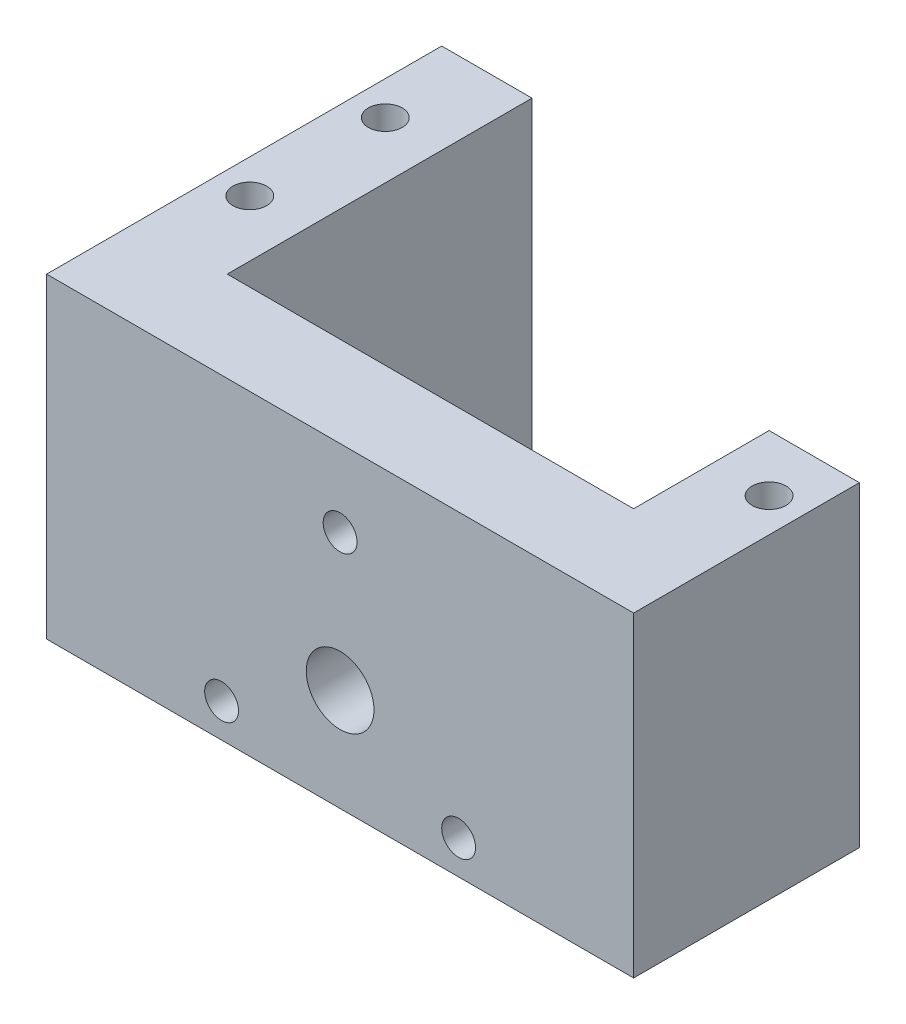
from build123d import *

# Parameters (mm, degrees)
SKETCH_1_W          = 36
SKETCH_1_H          = 28
SKETCH_1_R          = 1.5
SKETCH_1_R_2        = 8.5
EXTRUDE_1_DEPTH     = 8
SKETCH_2_R          = 8.5
SKETCH_2_R_2        = 3
EXTRUDE_2_DEPTH     = 5
SKETCH_3_W          = 8
SKETCH_3_H          = 28
EXTRUDE_3_DEPTH     = 35
SKETCH_4_R          = 1.5
CUT_EXTRUDE_1_DEPTH = 30
SKETCH_5_R          = 1.5
CUT_EXTRUDE_2_DEPTH = 54
SKETCH_7_W          = 8
SKETCH_7_H          = 15
CUT_EXTRUDE_3_DEPTH = 45


with BuildPart() as part:
    # Sketch 1 → Extrude 1 (new body)
    with BuildSketch(Plane.XY):
        Rectangle(SKETCH_1_W, SKETCH_1_H)
        with Locations((-10.5, -11)):
            Circle(SKETCH_1_R, mode=Mode.SUBTRACT)
        with Locations((0, 7.186533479)):
            Circle(SKETCH_1_R, mode=Mode.SUBTRACT)
        with Locations(Location((10.5, -11, 0), (0, 0, 180))):
            Circle(SKETCH_1_R, mode=Mode.SUBTRACT)
        with Locations((0, -4.937822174)):
            Circle(SKETCH_1_R_2, mode=Mode.SUBTRACT)
    extrude(amount=EXTRUDE_1_DEPTH)

    # Sketch 2 → Extrude 2 (add)
    with BuildSketch(Plane(origin=(0, 0, 0), x_dir=(-1, 0, 0), z_dir=(0, 0, -1))):
        with Locations((0, -4.937822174)):
            Circle(SKETCH_2_R)
        with Locations((0, -4.937822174)):
            Circle(SKETCH_2_R_2, mode=Mode.SUBTRACT)
    extrude(amount=-EXTRUDE_2_DEPTH)

    # Sketch 3 → Extrude 3 (add)
    with BuildSketch(Plane(origin=(0, 0, 0), x_dir=(-1, 0, 0), z_dir=(0, 0, -1))):
        with Locations((22, 0)):
            Rectangle(SKETCH_3_W, SKETCH_3_H)
        with Locations((-22, 0)):
            Rectangle(SKETCH_3_W, SKETCH_3_H)
    extrude(amount=-EXTRUDE_3_DEPTH)

    # Sketch 4 → Cut-Extrude 1 (cut)
    with BuildSketch(Plane(origin=(0, 14, 0), x_dir=(1, 0, 0), z_dir=(0, 1, 0))):
        with Locations(Location((-23, -15, 0), (0, 0, 180))):
            Circle(SKETCH_4_R)
        with Locations(Location((-23, -27, 0), (0, 0, 180))):
            Circle(SKETCH_4_R)
        with Locations(Location((23, -15, 0), (0, 0, 180))):
            Circle(SKETCH_4_R)
    extrude(amount=-CUT_EXTRUDE_1_DEPTH, mode=Mode.SUBTRACT)

    # Mirror 1: part across plane


with BuildPart() as part_1:
    add(part.part)
    add(part.part.mirror(Plane.XY))

    # Sketch 5 → Cut-Extrude 2 (cut)
    with BuildSketch(Plane(origin=(0, 14, 0), x_dir=(1, 0, 0), z_dir=(0, 1, 0))):
        Polygon((26, 0), (-26, 0), (-26, -35), (-18, -35), (-18, -8), (18, -8), (18, -35), (26, -35), align=None)
        with Locations((-23, -27)):
            Circle(SKETCH_5_R, mode=Mode.SUBTRACT)
        with Locations((-23, -15)):
            Circle(SKETCH_5_R, mode=Mode.SUBTRACT)
        with Locations((23, -15)):
            Circle(SKETCH_5_R, mode=Mode.SUBTRACT)
    extrude(amount=-CUT_EXTRUDE_2_DEPTH, mode=Mode.SUBTRACT)

    # Sketch 7 → Cut-Extrude 3 (cut)
    with BuildSketch(Plane(origin=(0, 14, 0), x_dir=(1, 0, 0), z_dir=(0, 1, 0))):
        with Locations((22, 27.5)):
            Rectangle(SKETCH_7_W, SKETCH_7_H)
    extrude(amount=-CUT_EXTRUDE_3_DEPTH, mode=Mode.SUBTRACT)


solid = part_1.part
